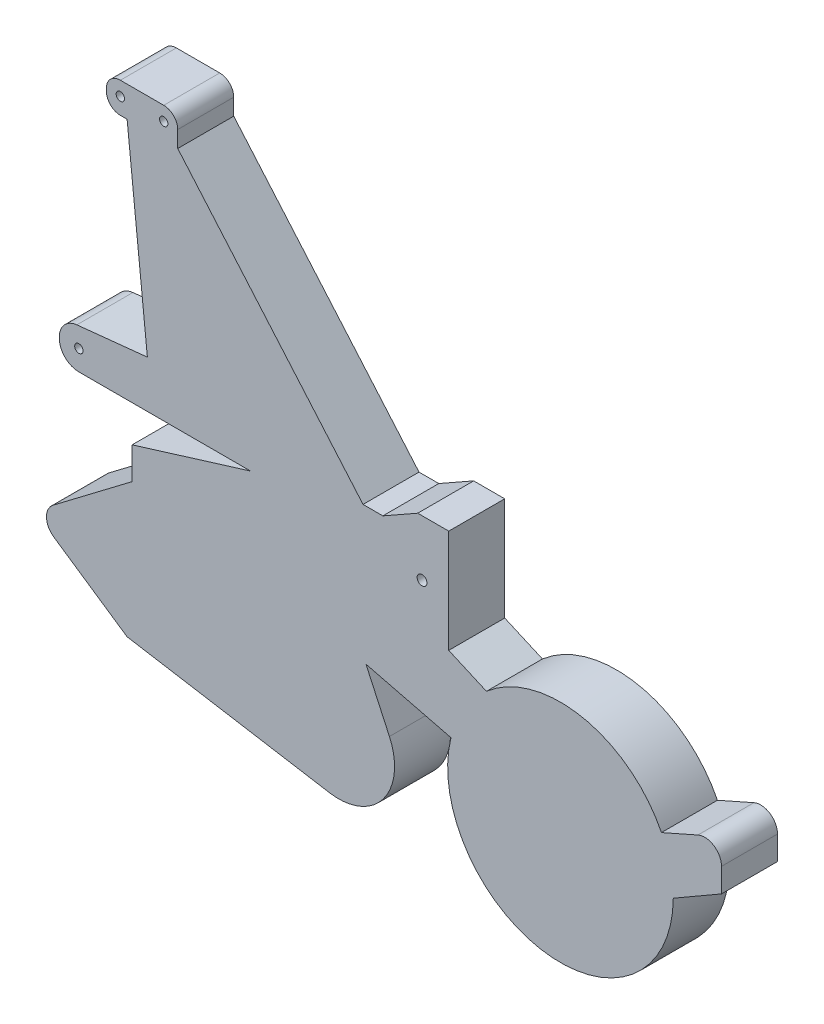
ISO-10303-21;
HEADER;
FILE_DESCRIPTION(('STEP AP214'),'2;1');
FILE_NAME('part.step','',(''),(''),'','','');
FILE_SCHEMA(('AUTOMOTIVE_DESIGN { 1 0 10303 214 1 1 1 1 }'));
ENDSEC;
DATA;
#1=APPLICATION_CONTEXT('core data for automotive mechanical design processes');
#2=APPLICATION_PROTOCOL_DEFINITION('international standard','automotive_design',2000,#1);
#3=PRODUCT_CONTEXT('',#1,'mechanical');
#4=PRODUCT('Part','Part','',(#3));
#5=PRODUCT_RELATED_PRODUCT_CATEGORY('part','',(#4));
#6=PRODUCT_DEFINITION_FORMATION('','',#4);
#7=PRODUCT_DEFINITION_CONTEXT('part definition',#1,'design');
#8=PRODUCT_DEFINITION('design','',#6,#7);
#9=PRODUCT_DEFINITION_SHAPE('','',#8);
#10=(LENGTH_UNIT() NAMED_UNIT(*) SI_UNIT(.MILLI.,.METRE.));
#11=(NAMED_UNIT(*) PLANE_ANGLE_UNIT() SI_UNIT($,.RADIAN.));
#12=(NAMED_UNIT(*) SI_UNIT($,.STERADIAN.) SOLID_ANGLE_UNIT());
#13=UNCERTAINTY_MEASURE_WITH_UNIT(LENGTH_MEASURE(1.E-05),#10,'distance_accuracy_value','');
#14=(GEOMETRIC_REPRESENTATION_CONTEXT(3) GLOBAL_UNCERTAINTY_ASSIGNED_CONTEXT((#13)) GLOBAL_UNIT_ASSIGNED_CONTEXT((#10,
#11,#12)) REPRESENTATION_CONTEXT('',''));
#15=CARTESIAN_POINT('',(0.,0.,0.));
#16=DIRECTION('',(0.,0.,1.));
#17=DIRECTION('',(1.,0.,0.));
#18=AXIS2_PLACEMENT_3D('',#15,#16,#17);
#19=CARTESIAN_POINT('',(460.031150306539,-221.494125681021,-61.8));
#20=DIRECTION('',(0.,0.,1.));
#21=DIRECTION('',(1.,0.,0.));
#22=AXIS2_PLACEMENT_3D('',#19,#20,#21);
#23=CYLINDRICAL_SURFACE('',#22,228.917831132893);
#24=CARTESIAN_POINT('',(460.031150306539,-221.494125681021,51.8));
#25=DIRECTION('',(0.,0.,1.));
#26=DIRECTION('',(1.,0.,0.));
#27=AXIS2_PLACEMENT_3D('',#24,#25,#26);
#28=CIRCLE('',#27,228.917831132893);
#29=CARTESIAN_POINT('',(664.933324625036,-119.423207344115,51.8));
#30=VERTEX_POINT('',#29);
#31=CARTESIAN_POINT('',(309.880680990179,-48.6988422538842,51.8));
#32=VERTEX_POINT('',#31);
#33=EDGE_CURVE('E260',#30,#32,#28,.T.);
#34=ORIENTED_EDGE('',*,*,#33,.F.);
#35=DIRECTION('',(0.,0.,1.));
#36=VECTOR('',#35,1.);
#37=CARTESIAN_POINT('',(664.933324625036,-119.423207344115,-61.8));
#38=LINE('',#37,#36);
#39=CARTESIAN_POINT('',(664.933324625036,-119.423207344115,-61.8));
#40=VERTEX_POINT('',#39);
#41=EDGE_CURVE('E11',#40,#30,#38,.T.);
#42=ORIENTED_EDGE('',*,*,#41,.F.);
#43=CARTESIAN_POINT('',(460.031150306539,-221.494125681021,-61.8));
#44=DIRECTION('',(0.,0.,1.));
#45=DIRECTION('',(1.,0.,0.));
#46=AXIS2_PLACEMENT_3D('',#43,#44,#45);
#47=CIRCLE('',#46,228.917831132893);
#48=CARTESIAN_POINT('',(309.880680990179,-48.6988422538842,-61.8));
#49=VERTEX_POINT('',#48);
#50=EDGE_CURVE('E262',#40,#49,#47,.T.);
#51=ORIENTED_EDGE('',*,*,#50,.T.);
#52=DIRECTION('',(0.,0.,1.));
#53=VECTOR('',#52,1.);
#54=CARTESIAN_POINT('',(309.880680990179,-48.6988422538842,-61.8));
#55=LINE('',#54,#53);
#56=EDGE_CURVE('E43',#49,#32,#55,.T.);
#57=ORIENTED_EDGE('',*,*,#56,.T.);
#58=EDGE_LOOP('',(#34,#42,#51,#57));
#59=FACE_BOUND('',#58,.T.);
#60=ADVANCED_FACE('F40',(#59),#23,.T.);
#61=CARTESIAN_POINT('',(738.946612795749,-86.673086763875,-61.8));
#62=DIRECTION('',(-0.404645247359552,0.914473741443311,0.));
#63=DIRECTION('',(-0.914473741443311,-0.404645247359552,0.));
#64=AXIS2_PLACEMENT_3D('',#61,#62,#63);
#65=PLANE('',#64);
#66=DIRECTION('',(-0.914473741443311,-0.404645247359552,0.));
#67=VECTOR('',#66,1.);
#68=CARTESIAN_POINT('',(738.946612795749,-86.673086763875,51.8));
#69=LINE('',#68,#67);
#70=CARTESIAN_POINT('',(738.946612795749,-86.673086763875,51.8));
#71=VERTEX_POINT('',#70);
#72=EDGE_CURVE('E278',#71,#30,#69,.T.);
#73=ORIENTED_EDGE('',*,*,#72,.F.);
#74=DIRECTION('',(0.,0.,1.));
#75=VECTOR('',#74,1.);
#76=CARTESIAN_POINT('',(738.946612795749,-86.673086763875,-61.8));
#77=LINE('',#76,#75);
#78=CARTESIAN_POINT('',(738.946612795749,-86.673086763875,-61.8));
#79=VERTEX_POINT('',#78);
#80=EDGE_CURVE('E48',#79,#71,#77,.T.);
#81=ORIENTED_EDGE('',*,*,#80,.F.);
#82=DIRECTION('',(-0.914473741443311,-0.404645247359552,0.));
#83=VECTOR('',#82,1.);
#84=CARTESIAN_POINT('',(738.946612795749,-86.673086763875,-61.8));
#85=LINE('',#84,#83);
#86=EDGE_CURVE('E267',#79,#40,#85,.T.);
#87=ORIENTED_EDGE('',*,*,#86,.T.);
#88=ORIENTED_EDGE('',*,*,#41,.T.);
#89=EDGE_LOOP('',(#73,#81,#87,#88));
#90=FACE_BOUND('',#89,.T.);
#91=ADVANCED_FACE('F659',(#90),#65,.T.);
#92=CARTESIAN_POINT('',(752.736922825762,-117.838351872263,-61.8));
#93=DIRECTION('',(0.,0.,1.));
#94=DIRECTION('',(1.,0.,0.));
#95=AXIS2_PLACEMENT_3D('',#92,#93,#94);
#96=CYLINDRICAL_SURFACE('',#95,34.08);
#97=CARTESIAN_POINT('',(752.736922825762,-117.838351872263,51.8));
#98=DIRECTION('',(0.,0.,1.));
#99=DIRECTION('',(-1.,0.,0.));
#100=AXIS2_PLACEMENT_3D('',#97,#98,#99);
#101=CIRCLE('',#100,34.08);
#102=CARTESIAN_POINT('',(786.816922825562,-117.838468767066,51.8));
#103=VERTEX_POINT('',#102);
#104=EDGE_CURVE('E374',#103,#71,#101,.T.);
#105=ORIENTED_EDGE('',*,*,#104,.F.);
#106=DIRECTION('',(0.,0.,1.));
#107=VECTOR('',#106,1.);
#108=CARTESIAN_POINT('',(786.816922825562,-117.838468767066,-61.8));
#109=LINE('',#108,#107);
#110=CARTESIAN_POINT('',(786.816922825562,-117.838468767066,-61.8));
#111=VERTEX_POINT('',#110);
#112=EDGE_CURVE('E473',#111,#103,#109,.T.);
#113=ORIENTED_EDGE('',*,*,#112,.F.);
#114=CARTESIAN_POINT('',(752.736922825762,-117.838351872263,-61.8));
#115=DIRECTION('',(0.,0.,1.));
#116=DIRECTION('',(-1.,0.,0.));
#117=AXIS2_PLACEMENT_3D('',#114,#115,#116);
#118=CIRCLE('',#117,34.08);
#119=EDGE_CURVE('E469',#111,#79,#118,.T.);
#120=ORIENTED_EDGE('',*,*,#119,.T.);
#121=ORIENTED_EDGE('',*,*,#80,.T.);
#122=EDGE_LOOP('',(#105,#113,#120,#121));
#123=FACE_BOUND('',#122,.T.);
#124=ADVANCED_FACE('F657',(#123),#96,.T.);
#125=CARTESIAN_POINT('',(786.816756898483,-166.213543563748,-61.8));
#126=DIRECTION('',(0.999999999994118,-3.43001183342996E-06,0.));
#127=DIRECTION('',(3.43001183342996E-06,0.999999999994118,0.));
#128=AXIS2_PLACEMENT_3D('',#125,#126,#127);
#129=PLANE('',#128);
#130=DIRECTION('',(3.43001183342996E-06,0.999999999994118,0.));
#131=VECTOR('',#130,1.);
#132=CARTESIAN_POINT('',(786.816756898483,-166.213543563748,51.8));
#133=LINE('',#132,#131);
#134=CARTESIAN_POINT('',(786.816756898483,-166.213543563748,51.8));
#135=VERTEX_POINT('',#134);
#136=EDGE_CURVE('E371',#135,#103,#133,.T.);
#137=ORIENTED_EDGE('',*,*,#136,.F.);
#138=DIRECTION('',(0.,0.,1.));
#139=VECTOR('',#138,1.);
#140=CARTESIAN_POINT('',(786.816756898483,-166.213543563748,-61.8));
#141=LINE('',#140,#139);
#142=CARTESIAN_POINT('',(786.816756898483,-166.213543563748,-61.8));
#143=VERTEX_POINT('',#142);
#144=EDGE_CURVE('E475',#143,#135,#141,.T.);
#145=ORIENTED_EDGE('',*,*,#144,.F.);
#146=DIRECTION('',(3.43001183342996E-06,0.999999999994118,0.));
#147=VECTOR('',#146,1.);
#148=CARTESIAN_POINT('',(786.816756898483,-166.213543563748,-61.8));
#149=LINE('',#148,#147);
#150=EDGE_CURVE('E466',#143,#111,#149,.T.);
#151=ORIENTED_EDGE('',*,*,#150,.T.);
#152=ORIENTED_EDGE('',*,*,#112,.T.);
#153=EDGE_LOOP('',(#137,#145,#151,#152));
#154=FACE_BOUND('',#153,.T.);
#155=ADVANCED_FACE('F653',(#154),#129,.T.);
#156=CARTESIAN_POINT('',(786.816756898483,-166.213543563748,-61.8));
#157=DIRECTION('',(0.500409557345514,-0.865788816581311,0.));
#158=DIRECTION('',(0.865788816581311,0.500409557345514,0.));
#159=AXIS2_PLACEMENT_3D('',#156,#157,#158);
#160=PLANE('',#159);
#161=DIRECTION('',(0.865788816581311,0.500409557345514,0.));
#162=VECTOR('',#161,1.);
#163=CARTESIAN_POINT('',(786.816756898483,-166.213543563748,51.8));
#164=LINE('',#163,#162);
#165=CARTESIAN_POINT('',(688.945362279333,-222.781358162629,51.8));
#166=VERTEX_POINT('',#165);
#167=EDGE_CURVE('E368',#166,#135,#164,.T.);
#168=ORIENTED_EDGE('',*,*,#167,.F.);
#169=DIRECTION('',(0.,0.,1.));
#170=VECTOR('',#169,1.);
#171=CARTESIAN_POINT('',(688.945362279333,-222.781358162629,-61.8));
#172=LINE('',#171,#170);
#173=CARTESIAN_POINT('',(688.945362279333,-222.781358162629,-61.8));
#174=VERTEX_POINT('',#173);
#175=EDGE_CURVE('E477',#174,#166,#172,.T.);
#176=ORIENTED_EDGE('',*,*,#175,.F.);
#177=DIRECTION('',(0.865788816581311,0.500409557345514,0.));
#178=VECTOR('',#177,1.);
#179=CARTESIAN_POINT('',(786.816756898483,-166.213543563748,-61.8));
#180=LINE('',#179,#178);
#181=EDGE_CURVE('E463',#174,#143,#180,.T.);
#182=ORIENTED_EDGE('',*,*,#181,.T.);
#183=ORIENTED_EDGE('',*,*,#144,.T.);
#184=EDGE_LOOP('',(#168,#176,#182,#183));
#185=FACE_BOUND('',#184,.T.);
#186=ADVANCED_FACE('F649',(#185),#160,.T.);
#187=CARTESIAN_POINT('',(460.031150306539,-221.494125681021,-61.8));
#188=DIRECTION('',(0.,0.,1.));
#189=DIRECTION('',(1.,0.,0.));
#190=AXIS2_PLACEMENT_3D('',#187,#188,#189);
#191=CYLINDRICAL_SURFACE('',#190,228.917831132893);
#192=CARTESIAN_POINT('',(460.031150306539,-221.494125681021,51.8));
#193=DIRECTION('',(0.,0.,1.));
#194=DIRECTION('',(1.,0.,0.));
#195=AXIS2_PLACEMENT_3D('',#192,#193,#194);
#196=CIRCLE('',#195,228.917831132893);
#197=CARTESIAN_POINT('',(237.888334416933,-166.213543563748,51.8));
#198=VERTEX_POINT('',#197);
#199=EDGE_CURVE('E365',#198,#166,#196,.T.);
#200=ORIENTED_EDGE('',*,*,#199,.F.);
#201=DIRECTION('',(0.,0.,1.));
#202=VECTOR('',#201,1.);
#203=CARTESIAN_POINT('',(237.888334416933,-166.213543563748,-61.8));
#204=LINE('',#203,#202);
#205=CARTESIAN_POINT('',(237.888334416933,-166.213543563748,-61.8));
#206=VERTEX_POINT('',#205);
#207=EDGE_CURVE('E479',#206,#198,#204,.T.);
#208=ORIENTED_EDGE('',*,*,#207,.F.);
#209=CARTESIAN_POINT('',(460.031150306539,-221.494125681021,-61.8));
#210=DIRECTION('',(0.,0.,1.));
#211=DIRECTION('',(1.,0.,0.));
#212=AXIS2_PLACEMENT_3D('',#209,#210,#211);
#213=CIRCLE('',#212,228.917831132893);
#214=EDGE_CURVE('E460',#206,#174,#213,.T.);
#215=ORIENTED_EDGE('',*,*,#214,.T.);
#216=ORIENTED_EDGE('',*,*,#175,.T.);
#217=EDGE_LOOP('',(#200,#208,#215,#216));
#218=FACE_BOUND('',#217,.T.);
#219=ADVANCED_FACE('F645',(#218),#191,.T.);
#220=CARTESIAN_POINT('',(237.888334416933,-166.213543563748,-61.8));
#221=DIRECTION('',(-0.241486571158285,-0.970404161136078,0.));
#222=DIRECTION('',(0.970404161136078,-0.241486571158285,0.));
#223=AXIS2_PLACEMENT_3D('',#220,#221,#222);
#224=PLANE('',#223);
#225=DIRECTION('',(0.970404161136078,-0.241486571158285,0.));
#226=VECTOR('',#225,1.);
#227=CARTESIAN_POINT('',(237.888334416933,-166.213543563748,51.8));
#228=LINE('',#227,#226);
#229=CARTESIAN_POINT('',(65.3918024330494,-123.287515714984,51.8));
#230=VERTEX_POINT('',#229);
#231=EDGE_CURVE('E362',#230,#198,#228,.T.);
#232=ORIENTED_EDGE('',*,*,#231,.F.);
#233=DIRECTION('',(0.,0.,1.));
#234=VECTOR('',#233,1.);
#235=CARTESIAN_POINT('',(65.3918024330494,-123.287515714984,-61.8));
#236=LINE('',#235,#234);
#237=CARTESIAN_POINT('',(65.3918024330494,-123.287515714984,-61.8));
#238=VERTEX_POINT('',#237);
#239=EDGE_CURVE('E481',#238,#230,#236,.T.);
#240=ORIENTED_EDGE('',*,*,#239,.F.);
#241=DIRECTION('',(0.970404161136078,-0.241486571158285,0.));
#242=VECTOR('',#241,1.);
#243=CARTESIAN_POINT('',(237.888334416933,-166.213543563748,-61.8));
#244=LINE('',#243,#242);
#245=EDGE_CURVE('E457',#238,#206,#244,.T.);
#246=ORIENTED_EDGE('',*,*,#245,.T.);
#247=ORIENTED_EDGE('',*,*,#207,.T.);
#248=EDGE_LOOP('',(#232,#240,#246,#247));
#249=FACE_BOUND('',#248,.T.);
#250=ADVANCED_FACE('F641',(#249),#224,.T.);
#251=CARTESIAN_POINT('',(65.3918024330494,-123.287515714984,-61.8));
#252=DIRECTION('',(0.908109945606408,0.418731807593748,0.));
#253=DIRECTION('',(-0.418731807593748,0.908109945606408,0.));
#254=AXIS2_PLACEMENT_3D('',#251,#252,#253);
#255=PLANE('',#254);
#256=DIRECTION('',(-0.418731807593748,0.908109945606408,0.));
#257=VECTOR('',#256,1.);
#258=CARTESIAN_POINT('',(65.3918024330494,-123.287515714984,51.8));
#259=LINE('',#258,#257);
#260=CARTESIAN_POINT('',(113.000601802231,-226.537432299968,51.8));
#261=VERTEX_POINT('',#260);
#262=EDGE_CURVE('E359',#261,#230,#259,.T.);
#263=ORIENTED_EDGE('',*,*,#262,.F.);
#264=DIRECTION('',(0.,0.,1.));
#265=VECTOR('',#264,1.);
#266=CARTESIAN_POINT('',(113.000601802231,-226.537432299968,-61.8));
#267=LINE('',#266,#265);
#268=CARTESIAN_POINT('',(113.000601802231,-226.537432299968,-61.8));
#269=VERTEX_POINT('',#268);
#270=EDGE_CURVE('E483',#269,#261,#267,.T.);
#271=ORIENTED_EDGE('',*,*,#270,.F.);
#272=DIRECTION('',(-0.418731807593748,0.908109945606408,0.));
#273=VECTOR('',#272,1.);
#274=CARTESIAN_POINT('',(65.3918024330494,-123.287515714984,-61.8));
#275=LINE('',#274,#273);
#276=EDGE_CURVE('E454',#269,#238,#275,.T.);
#277=ORIENTED_EDGE('',*,*,#276,.T.);
#278=ORIENTED_EDGE('',*,*,#239,.T.);
#279=EDGE_LOOP('',(#263,#271,#277,#278));
#280=FACE_BOUND('',#279,.T.);
#281=ADVANCED_FACE('F637',(#280),#255,.T.);
#282=CARTESIAN_POINT('',(9.83931198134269,-274.105365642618,-61.8));
#283=DIRECTION('',(0.,0.,1.));
#284=DIRECTION('',(1.,0.,0.));
#285=AXIS2_PLACEMENT_3D('',#282,#283,#284);
#286=CYLINDRICAL_SURFACE('',#285,113.6);
#287=CARTESIAN_POINT('',(9.83931198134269,-274.105365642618,51.8));
#288=DIRECTION('',(0.,0.,1.));
#289=DIRECTION('',(1.,0.,0.));
#290=AXIS2_PLACEMENT_3D('',#287,#288,#289);
#291=CIRCLE('',#290,113.6);
#292=CARTESIAN_POINT('',(-8.89333512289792,-386.150213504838,51.8));
#293=VERTEX_POINT('',#292);
#294=EDGE_CURVE('E356',#293,#261,#291,.T.);
#295=ORIENTED_EDGE('',*,*,#294,.F.);
#296=DIRECTION('',(0.,0.,1.));
#297=VECTOR('',#296,1.);
#298=CARTESIAN_POINT('',(-8.89333512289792,-386.150213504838,-61.8));
#299=LINE('',#298,#297);
#300=CARTESIAN_POINT('',(-8.89333512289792,-386.150213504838,-61.8));
#301=VERTEX_POINT('',#300);
#302=EDGE_CURVE('E485',#301,#293,#299,.T.);
#303=ORIENTED_EDGE('',*,*,#302,.F.);
#304=CARTESIAN_POINT('',(9.83931198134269,-274.105365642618,-61.8));
#305=DIRECTION('',(0.,0.,1.));
#306=DIRECTION('',(1.,0.,0.));
#307=AXIS2_PLACEMENT_3D('',#304,#305,#306);
#308=CIRCLE('',#307,113.6);
#309=EDGE_CURVE('E451',#301,#269,#308,.T.);
#310=ORIENTED_EDGE('',*,*,#309,.T.);
#311=ORIENTED_EDGE('',*,*,#270,.T.);
#312=EDGE_LOOP('',(#295,#303,#310,#311));
#313=FACE_BOUND('',#312,.T.);
#314=ADVANCED_FACE('F633',(#313),#286,.T.);
#315=CARTESIAN_POINT('',(-8.89333512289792,-386.150213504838,-61.8));
#316=DIRECTION('',(-0.164900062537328,-0.986310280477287,0.));
#317=DIRECTION('',(0.986310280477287,-0.164900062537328,0.));
#318=AXIS2_PLACEMENT_3D('',#315,#316,#317);
#319=PLANE('',#318);
#320=DIRECTION('',(0.986310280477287,-0.164900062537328,0.));
#321=VECTOR('',#320,1.);
#322=CARTESIAN_POINT('',(-8.89333512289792,-386.150213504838,51.8));
#323=LINE('',#322,#321);
#324=CARTESIAN_POINT('',(-419.258489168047,-317.541743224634,51.8));
#325=VERTEX_POINT('',#324);
#326=EDGE_CURVE('E353',#325,#293,#323,.T.);
#327=ORIENTED_EDGE('',*,*,#326,.F.);
#328=DIRECTION('',(0.,0.,1.));
#329=VECTOR('',#328,1.);
#330=CARTESIAN_POINT('',(-419.258489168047,-317.541743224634,-61.8));
#331=LINE('',#330,#329);
#332=CARTESIAN_POINT('',(-419.258489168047,-317.541743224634,-61.8));
#333=VERTEX_POINT('',#332);
#334=EDGE_CURVE('E487',#333,#325,#331,.T.);
#335=ORIENTED_EDGE('',*,*,#334,.F.);
#336=DIRECTION('',(0.986310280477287,-0.164900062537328,0.));
#337=VECTOR('',#336,1.);
#338=CARTESIAN_POINT('',(-8.89333512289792,-386.150213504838,-61.8));
#339=LINE('',#338,#337);
#340=EDGE_CURVE('E448',#333,#301,#339,.T.);
#341=ORIENTED_EDGE('',*,*,#340,.T.);
#342=ORIENTED_EDGE('',*,*,#302,.T.);
#343=EDGE_LOOP('',(#327,#335,#341,#342));
#344=FACE_BOUND('',#343,.T.);
#345=ADVANCED_FACE('F629',(#344),#319,.T.);
#346=CARTESIAN_POINT('',(-419.258489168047,-317.541743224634,-61.8));
#347=DIRECTION('',(-0.561644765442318,-0.827378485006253,0.));
#348=DIRECTION('',(0.827378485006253,-0.561644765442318,0.));
#349=AXIS2_PLACEMENT_3D('',#346,#347,#348);
#350=PLANE('',#349);
#351=DIRECTION('',(0.827378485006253,-0.561644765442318,0.));
#352=VECTOR('',#351,1.);
#353=CARTESIAN_POINT('',(-419.258489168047,-317.541743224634,51.8));
#354=LINE('',#353,#352);
#355=CARTESIAN_POINT('',(-567.913551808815,-216.631048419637,51.8));
#356=VERTEX_POINT('',#355);
#357=EDGE_CURVE('E350',#356,#325,#354,.T.);
#358=ORIENTED_EDGE('',*,*,#357,.F.);
#359=DIRECTION('',(0.,0.,1.));
#360=VECTOR('',#359,1.);
#361=CARTESIAN_POINT('',(-567.913551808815,-216.631048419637,-61.8));
#362=LINE('',#361,#360);
#363=CARTESIAN_POINT('',(-567.913551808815,-216.631048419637,-61.8));
#364=VERTEX_POINT('',#363);
#365=EDGE_CURVE('E489',#364,#356,#362,.T.);
#366=ORIENTED_EDGE('',*,*,#365,.F.);
#367=DIRECTION('',(0.827378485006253,-0.561644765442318,0.));
#368=VECTOR('',#367,1.);
#369=CARTESIAN_POINT('',(-419.258489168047,-317.541743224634,-61.8));
#370=LINE('',#369,#368);
#371=EDGE_CURVE('E445',#364,#333,#370,.T.);
#372=ORIENTED_EDGE('',*,*,#371,.T.);
#373=ORIENTED_EDGE('',*,*,#334,.T.);
#374=EDGE_LOOP('',(#358,#366,#372,#373));
#375=FACE_BOUND('',#374,.T.);
#376=ADVANCED_FACE('F625',(#375),#350,.T.);
#377=CARTESIAN_POINT('',(-548.772698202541,-188.433989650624,-61.8));
#378=DIRECTION('',(0.,0.,1.));
#379=DIRECTION('',(1.,0.,0.));
#380=AXIS2_PLACEMENT_3D('',#377,#378,#379);
#381=CYLINDRICAL_SURFACE('',#380,34.08);
#382=CARTESIAN_POINT('',(-548.772698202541,-188.433989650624,51.8));
#383=DIRECTION('',(0.,0.,1.));
#384=DIRECTION('',(-1.,0.,0.));
#385=AXIS2_PLACEMENT_3D('',#382,#383,#384);
#386=CIRCLE('',#385,34.08);
#387=CARTESIAN_POINT('',(-569.36060090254,-161.275479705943,51.8));
#388=VERTEX_POINT('',#387);
#389=EDGE_CURVE('E347',#388,#356,#386,.T.);
#390=ORIENTED_EDGE('',*,*,#389,.F.);
#391=DIRECTION('',(0.,0.,1.));
#392=VECTOR('',#391,1.);
#393=CARTESIAN_POINT('',(-569.36060090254,-161.275479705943,-61.8));
#394=LINE('',#393,#392);
#395=CARTESIAN_POINT('',(-569.36060090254,-161.275479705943,-61.8));
#396=VERTEX_POINT('',#395);
#397=EDGE_CURVE('E491',#396,#388,#394,.T.);
#398=ORIENTED_EDGE('',*,*,#397,.F.);
#399=CARTESIAN_POINT('',(-548.772698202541,-188.433989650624,-61.8));
#400=DIRECTION('',(0.,0.,1.));
#401=DIRECTION('',(-1.,0.,0.));
#402=AXIS2_PLACEMENT_3D('',#399,#400,#401);
#403=CIRCLE('',#402,34.08);
#404=EDGE_CURVE('E442',#396,#364,#403,.T.);
#405=ORIENTED_EDGE('',*,*,#404,.T.);
#406=ORIENTED_EDGE('',*,*,#365,.T.);
#407=EDGE_LOOP('',(#390,#398,#405,#406));
#408=FACE_BOUND('',#407,.T.);
#409=ADVANCED_FACE('F621',(#408),#381,.T.);
#410=CARTESIAN_POINT('',(-569.36060090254,-161.275479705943,-61.8));
#411=DIRECTION('',(-0.60410512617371,0.796904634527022,0.));
#412=DIRECTION('',(-0.796904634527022,-0.60410512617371,0.));
#413=AXIS2_PLACEMENT_3D('',#410,#411,#412);
#414=PLANE('',#413);
#415=DIRECTION('',(-0.796904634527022,-0.60410512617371,0.));
#416=VECTOR('',#415,1.);
#417=CARTESIAN_POINT('',(-569.36060090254,-161.275479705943,51.8));
#418=LINE('',#417,#416);
#419=CARTESIAN_POINT('',(-408.962527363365,-39.6833917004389,51.8));
#420=VERTEX_POINT('',#419);
#421=EDGE_CURVE('E344',#420,#388,#418,.T.);
#422=ORIENTED_EDGE('',*,*,#421,.F.);
#423=DIRECTION('',(0.,0.,1.));
#424=VECTOR('',#423,1.);
#425=CARTESIAN_POINT('',(-408.962527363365,-39.6833917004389,-61.8));
#426=LINE('',#425,#424);
#427=CARTESIAN_POINT('',(-408.962527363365,-39.6833917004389,-61.8));
#428=VERTEX_POINT('',#427);
#429=EDGE_CURVE('E493',#428,#420,#426,.T.);
#430=ORIENTED_EDGE('',*,*,#429,.F.);
#431=DIRECTION('',(-0.796904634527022,-0.60410512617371,0.));
#432=VECTOR('',#431,1.);
#433=CARTESIAN_POINT('',(-569.36060090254,-161.275479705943,-61.8));
#434=LINE('',#433,#432);
#435=EDGE_CURVE('E439',#428,#396,#434,.T.);
#436=ORIENTED_EDGE('',*,*,#435,.T.);
#437=ORIENTED_EDGE('',*,*,#397,.T.);
#438=EDGE_LOOP('',(#422,#430,#436,#437));
#439=FACE_BOUND('',#438,.T.);
#440=ADVANCED_FACE('F617',(#439),#414,.T.);
#441=CARTESIAN_POINT('',(-408.962527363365,-39.6833917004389,-61.8));
#442=DIRECTION('',(-1.,0.,0.));
#443=DIRECTION('',(0.,0.,1.));
#444=AXIS2_PLACEMENT_3D('',#441,#442,#443);
#445=PLANE('',#444);
#446=DIRECTION('',(0.,-1.,0.));
#447=VECTOR('',#446,1.);
#448=CARTESIAN_POINT('',(-408.962527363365,-39.6833917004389,51.8));
#449=LINE('',#448,#447);
#450=CARTESIAN_POINT('',(-408.962527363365,25.028903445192,51.8));
#451=VERTEX_POINT('',#450);
#452=EDGE_CURVE('E341',#451,#420,#449,.T.);
#453=ORIENTED_EDGE('',*,*,#452,.F.);
#454=DIRECTION('',(0.,0.,1.));
#455=VECTOR('',#454,1.);
#456=CARTESIAN_POINT('',(-408.962527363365,25.028903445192,-61.8));
#457=LINE('',#456,#455);
#458=CARTESIAN_POINT('',(-408.962527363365,25.028903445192,-61.8));
#459=VERTEX_POINT('',#458);
#460=EDGE_CURVE('E495',#459,#451,#457,.T.);
#461=ORIENTED_EDGE('',*,*,#460,.F.);
#462=DIRECTION('',(0.,-1.,0.));
#463=VECTOR('',#462,1.);
#464=CARTESIAN_POINT('',(-408.962527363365,-39.6833917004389,-61.8));
#465=LINE('',#464,#463);
#466=EDGE_CURVE('E436',#459,#428,#465,.T.);
#467=ORIENTED_EDGE('',*,*,#466,.T.);
#468=ORIENTED_EDGE('',*,*,#429,.T.);
#469=EDGE_LOOP('',(#453,#461,#467,#468));
#470=FACE_BOUND('',#469,.T.);
#471=ADVANCED_FACE('F613',(#470),#445,.T.);
#472=CARTESIAN_POINT('',(-408.962527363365,25.028903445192,-61.8));
#473=DIRECTION('',(-0.294085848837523,0.95577900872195,0.));
#474=DIRECTION('',(-0.95577900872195,-0.294085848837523,0.));
#475=AXIS2_PLACEMENT_3D('',#472,#473,#474);
#476=PLANE('',#475);
#477=DIRECTION('',(-0.95577900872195,-0.294085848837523,0.));
#478=VECTOR('',#477,1.);
#479=CARTESIAN_POINT('',(-408.962527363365,25.028903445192,51.8));
#480=LINE('',#479,#478);
#481=CARTESIAN_POINT('',(-168.602573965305,98.9858121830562,51.8));
#482=VERTEX_POINT('',#481);
#483=EDGE_CURVE('E338',#482,#451,#480,.T.);
#484=ORIENTED_EDGE('',*,*,#483,.F.);
#485=DIRECTION('',(0.,0.,1.));
#486=VECTOR('',#485,1.);
#487=CARTESIAN_POINT('',(-168.602573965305,98.9858121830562,-61.8));
#488=LINE('',#487,#486);
#489=CARTESIAN_POINT('',(-168.602573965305,98.9858121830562,-61.8));
#490=VERTEX_POINT('',#489);
#491=EDGE_CURVE('E497',#490,#482,#488,.T.);
#492=ORIENTED_EDGE('',*,*,#491,.F.);
#493=DIRECTION('',(-0.95577900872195,-0.294085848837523,0.));
#494=VECTOR('',#493,1.);
#495=CARTESIAN_POINT('',(-408.962527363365,25.028903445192,-61.8));
#496=LINE('',#495,#494);
#497=EDGE_CURVE('E433',#490,#459,#496,.T.);
#498=ORIENTED_EDGE('',*,*,#497,.T.);
#499=ORIENTED_EDGE('',*,*,#460,.T.);
#500=EDGE_LOOP('',(#484,#492,#498,#499));
#501=FACE_BOUND('',#500,.T.);
#502=ADVANCED_FACE('F609',(#501),#476,.T.);
#503=CARTESIAN_POINT('',(-168.602573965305,98.9858121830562,-61.8));
#504=DIRECTION('',(0.,-1.,0.));
#505=DIRECTION('',(0.,0.,-1.));
#506=AXIS2_PLACEMENT_3D('',#503,#504,#505);
#507=PLANE('',#506);
#508=DIRECTION('',(1.,0.,0.));
#509=VECTOR('',#508,1.);
#510=CARTESIAN_POINT('',(-168.602573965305,98.9858121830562,51.8));
#511=LINE('',#510,#509);
#512=CARTESIAN_POINT('',(-517.116344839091,98.9858121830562,51.8));
#513=VERTEX_POINT('',#512);
#514=EDGE_CURVE('E335',#513,#482,#511,.T.);
#515=ORIENTED_EDGE('',*,*,#514,.F.);
#516=DIRECTION('',(0.,0.,1.));
#517=VECTOR('',#516,1.);
#518=CARTESIAN_POINT('',(-517.116344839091,98.9858121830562,-61.8));
#519=LINE('',#518,#517);
#520=CARTESIAN_POINT('',(-517.116344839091,98.9858121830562,-61.8));
#521=VERTEX_POINT('',#520);
#522=EDGE_CURVE('E499',#521,#513,#519,.T.);
#523=ORIENTED_EDGE('',*,*,#522,.F.);
#524=DIRECTION('',(1.,0.,0.));
#525=VECTOR('',#524,1.);
#526=CARTESIAN_POINT('',(-168.602573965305,98.9858121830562,-61.8));
#527=LINE('',#526,#525);
#528=EDGE_CURVE('E430',#521,#490,#527,.T.);
#529=ORIENTED_EDGE('',*,*,#528,.T.);
#530=ORIENTED_EDGE('',*,*,#491,.T.);
#531=EDGE_LOOP('',(#515,#523,#529,#530));
#532=FACE_BOUND('',#531,.T.);
#533=ADVANCED_FACE('F605',(#532),#507,.T.);
#534=CARTESIAN_POINT('',(-517.116344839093,138.745812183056,-61.8));
#535=DIRECTION('',(0.,0.,1.));
#536=DIRECTION('',(1.,0.,0.));
#537=AXIS2_PLACEMENT_3D('',#534,#535,#536);
#538=CYLINDRICAL_SURFACE('',#537,39.76);
#539=CARTESIAN_POINT('',(-517.116344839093,138.745812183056,51.8));
#540=DIRECTION('',(0.,0.,1.));
#541=DIRECTION('',(-1.,0.,0.));
#542=AXIS2_PLACEMENT_3D('',#539,#540,#541);
#543=CIRCLE('',#542,39.76);
#544=CARTESIAN_POINT('',(-556.876344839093,138.745812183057,51.8));
#545=VERTEX_POINT('',#544);
#546=EDGE_CURVE('E332',#545,#513,#543,.T.);
#547=ORIENTED_EDGE('',*,*,#546,.F.);
#548=DIRECTION('',(0.,0.,1.));
#549=VECTOR('',#548,1.);
#550=CARTESIAN_POINT('',(-556.876344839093,138.745812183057,-61.8));
#551=LINE('',#550,#549);
#552=CARTESIAN_POINT('',(-556.876344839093,138.745812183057,-61.8));
#553=VERTEX_POINT('',#552);
#554=EDGE_CURVE('E501',#553,#545,#551,.T.);
#555=ORIENTED_EDGE('',*,*,#554,.F.);
#556=CARTESIAN_POINT('',(-517.116344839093,138.745812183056,-61.8));
#557=DIRECTION('',(0.,0.,1.));
#558=DIRECTION('',(-1.,0.,0.));
#559=AXIS2_PLACEMENT_3D('',#556,#557,#558);
#560=CIRCLE('',#559,39.76);
#561=EDGE_CURVE('E427',#553,#521,#560,.T.);
#562=ORIENTED_EDGE('',*,*,#561,.T.);
#563=ORIENTED_EDGE('',*,*,#522,.T.);
#564=EDGE_LOOP('',(#547,#555,#562,#563));
#565=FACE_BOUND('',#564,.T.);
#566=ADVANCED_FACE('F601',(#565),#538,.T.);
#567=CARTESIAN_POINT('',(-556.876344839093,138.745812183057,-61.8));
#568=DIRECTION('',(-1.,0.,0.));
#569=DIRECTION('',(0.,0.,1.));
#570=AXIS2_PLACEMENT_3D('',#567,#568,#569);
#571=PLANE('',#570);
#572=DIRECTION('',(0.,-1.,0.));
#573=VECTOR('',#572,1.);
#574=CARTESIAN_POINT('',(-556.876344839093,138.745812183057,51.8));
#575=LINE('',#574,#573);
#576=CARTESIAN_POINT('',(-556.876344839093,140.165181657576,51.8));
#577=VERTEX_POINT('',#576);
#578=EDGE_CURVE('E329',#577,#545,#575,.T.);
#579=ORIENTED_EDGE('',*,*,#578,.F.);
#580=DIRECTION('',(0.,0.,1.));
#581=VECTOR('',#580,1.);
#582=CARTESIAN_POINT('',(-556.876344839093,140.165181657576,-61.8));
#583=LINE('',#582,#581);
#584=CARTESIAN_POINT('',(-556.876344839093,140.165181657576,-61.8));
#585=VERTEX_POINT('',#584);
#586=EDGE_CURVE('E503',#585,#577,#583,.T.);
#587=ORIENTED_EDGE('',*,*,#586,.F.);
#588=DIRECTION('',(0.,-1.,0.));
#589=VECTOR('',#588,1.);
#590=CARTESIAN_POINT('',(-556.876344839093,138.745812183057,-61.8));
#591=LINE('',#590,#589);
#592=EDGE_CURVE('E424',#585,#553,#591,.T.);
#593=ORIENTED_EDGE('',*,*,#592,.T.);
#594=ORIENTED_EDGE('',*,*,#554,.T.);
#595=EDGE_LOOP('',(#579,#587,#593,#594));
#596=FACE_BOUND('',#595,.T.);
#597=ADVANCED_FACE('F597',(#596),#571,.T.);
#598=CARTESIAN_POINT('',(-517.116344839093,140.165181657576,-61.8));
#599=DIRECTION('',(0.,0.,1.));
#600=DIRECTION('',(1.,0.,0.));
#601=AXIS2_PLACEMENT_3D('',#598,#599,#600);
#602=CYLINDRICAL_SURFACE('',#601,39.76);
#603=CARTESIAN_POINT('',(-517.116344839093,140.165181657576,51.8));
#604=DIRECTION('',(0.,0.,1.));
#605=DIRECTION('',(-1.,0.,0.));
#606=AXIS2_PLACEMENT_3D('',#603,#604,#605);
#607=CIRCLE('',#606,39.76);
#608=CARTESIAN_POINT('',(-521.207615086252,179.71412738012,51.8));
#609=VERTEX_POINT('',#608);
#610=EDGE_CURVE('E326',#609,#577,#607,.T.);
#611=ORIENTED_EDGE('',*,*,#610,.F.);
#612=DIRECTION('',(0.,0.,1.));
#613=VECTOR('',#612,1.);
#614=CARTESIAN_POINT('',(-521.207615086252,179.71412738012,-61.8));
#615=LINE('',#614,#613);
#616=CARTESIAN_POINT('',(-521.207615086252,179.71412738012,-61.8));
#617=VERTEX_POINT('',#616);
#618=EDGE_CURVE('E505',#617,#609,#615,.T.);
#619=ORIENTED_EDGE('',*,*,#618,.F.);
#620=CARTESIAN_POINT('',(-517.116344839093,140.165181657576,-61.8));
#621=DIRECTION('',(0.,0.,1.));
#622=DIRECTION('',(-1.,0.,0.));
#623=AXIS2_PLACEMENT_3D('',#620,#621,#622);
#624=CIRCLE('',#623,39.76);
#625=EDGE_CURVE('E421',#617,#585,#624,.T.);
#626=ORIENTED_EDGE('',*,*,#625,.T.);
#627=ORIENTED_EDGE('',*,*,#586,.T.);
#628=EDGE_LOOP('',(#611,#619,#626,#627));
#629=FACE_BOUND('',#628,.T.);
#630=ADVANCED_FACE('F595',(#629),#602,.T.);
#631=CARTESIAN_POINT('',(-521.207615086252,179.71412738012,-61.8));
#632=DIRECTION('',(-0.102899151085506,0.994691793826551,0.));
#633=DIRECTION('',(-0.994691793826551,-0.102899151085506,0.));
#634=AXIS2_PLACEMENT_3D('',#631,#632,#633);
#635=PLANE('',#634);
#636=DIRECTION('',(-0.994691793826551,-0.102899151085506,0.));
#637=VECTOR('',#636,1.);
#638=CARTESIAN_POINT('',(-521.207615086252,179.71412738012,51.8));
#639=LINE('',#638,#637);
#640=CARTESIAN_POINT('',(-378.147148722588,194.513485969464,51.8));
#641=VERTEX_POINT('',#640);
#642=EDGE_CURVE('E323',#641,#609,#639,.T.);
#643=ORIENTED_EDGE('',*,*,#642,.F.);
#644=DIRECTION('',(0.,0.,1.));
#645=VECTOR('',#644,1.);
#646=CARTESIAN_POINT('',(-378.147148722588,194.513485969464,-61.8));
#647=LINE('',#646,#645);
#648=CARTESIAN_POINT('',(-378.147148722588,194.513485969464,-61.8));
#649=VERTEX_POINT('',#648);
#650=EDGE_CURVE('E507',#649,#641,#647,.T.);
#651=ORIENTED_EDGE('',*,*,#650,.F.);
#652=DIRECTION('',(-0.994691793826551,-0.102899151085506,0.));
#653=VECTOR('',#652,1.);
#654=CARTESIAN_POINT('',(-521.207615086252,179.71412738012,-61.8));
#655=LINE('',#654,#653);
#656=EDGE_CURVE('E418',#649,#617,#655,.T.);
#657=ORIENTED_EDGE('',*,*,#656,.T.);
#658=ORIENTED_EDGE('',*,*,#618,.T.);
#659=EDGE_LOOP('',(#643,#651,#657,#658));
#660=FACE_BOUND('',#659,.T.);
#661=ADVANCED_FACE('F591',(#660),#635,.T.);
#662=CARTESIAN_POINT('',(-378.147148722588,194.513485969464,-61.8));
#663=DIRECTION('',(-0.994691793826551,-0.102899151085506,0.));
#664=DIRECTION('',(0.102899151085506,-0.994691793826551,0.));
#665=AXIS2_PLACEMENT_3D('',#662,#663,#664);
#666=PLANE('',#665);
#667=DIRECTION('',(0.102899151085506,-0.994691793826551,0.));
#668=VECTOR('',#667,1.);
#669=CARTESIAN_POINT('',(-378.147148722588,194.513485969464,51.8));
#670=LINE('',#669,#668);
#671=CARTESIAN_POINT('',(-419.258489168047,591.923110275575,51.8));
#672=VERTEX_POINT('',#671);
#673=EDGE_CURVE('E320',#672,#641,#670,.T.);
#674=ORIENTED_EDGE('',*,*,#673,.F.);
#675=DIRECTION('',(0.,0.,1.));
#676=VECTOR('',#675,1.);
#677=CARTESIAN_POINT('',(-419.258489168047,591.923110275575,-61.8));
#678=LINE('',#677,#676);
#679=CARTESIAN_POINT('',(-419.258489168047,591.923110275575,-61.8));
#680=VERTEX_POINT('',#679);
#681=EDGE_CURVE('E509',#680,#672,#678,.T.);
#682=ORIENTED_EDGE('',*,*,#681,.F.);
#683=DIRECTION('',(0.102899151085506,-0.994691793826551,0.));
#684=VECTOR('',#683,1.);
#685=CARTESIAN_POINT('',(-385.281815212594,263.481928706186,-61.8));
#686=LINE('',#685,#684);
#687=EDGE_CURVE('E416',#680,#649,#686,.T.);
#688=ORIENTED_EDGE('',*,*,#687,.T.);
#689=ORIENTED_EDGE('',*,*,#650,.T.);
#690=EDGE_LOOP('',(#674,#682,#688,#689));
#691=FACE_BOUND('',#690,.T.);
#692=ADVANCED_FACE('F582',(#691),#666,.T.);
#693=CARTESIAN_POINT('',(-419.258489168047,591.923110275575,-61.8));
#694=DIRECTION('',(0.,-1.,0.));
#695=DIRECTION('',(0.,0.,-1.));
#696=AXIS2_PLACEMENT_3D('',#693,#694,#695);
#697=PLANE('',#696);
#698=DIRECTION('',(1.,0.,0.));
#699=VECTOR('',#698,1.);
#700=CARTESIAN_POINT('',(-419.258489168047,591.923110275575,51.8));
#701=LINE('',#700,#699);
#702=CARTESIAN_POINT('',(-432.948671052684,591.923110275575,51.8));
#703=VERTEX_POINT('',#702);
#704=EDGE_CURVE('E317',#703,#672,#701,.T.);
#705=ORIENTED_EDGE('',*,*,#704,.F.);
#706=DIRECTION('',(0.,0.,1.));
#707=VECTOR('',#706,1.);
#708=CARTESIAN_POINT('',(-432.948671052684,591.923110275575,-61.8));
#709=LINE('',#708,#707);
#710=CARTESIAN_POINT('',(-432.948671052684,591.923110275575,-61.8));
#711=VERTEX_POINT('',#710);
#712=EDGE_CURVE('E512',#711,#703,#709,.T.);
#713=ORIENTED_EDGE('',*,*,#712,.F.);
#714=DIRECTION('',(1.,0.,0.));
#715=VECTOR('',#714,1.);
#716=CARTESIAN_POINT('',(-419.258489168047,591.923110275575,-61.8));
#717=LINE('',#716,#715);
#718=EDGE_CURVE('E413',#711,#680,#717,.T.);
#719=ORIENTED_EDGE('',*,*,#718,.T.);
#720=ORIENTED_EDGE('',*,*,#681,.T.);
#721=EDGE_LOOP('',(#705,#713,#719,#720));
#722=FACE_BOUND('',#721,.T.);
#723=ADVANCED_FACE('F578',(#722),#697,.T.);
#724=CARTESIAN_POINT('',(-432.948671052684,620.323110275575,-61.8));
#725=DIRECTION('',(0.,0.,1.));
#726=DIRECTION('',(1.,0.,0.));
#727=AXIS2_PLACEMENT_3D('',#724,#725,#726);
#728=CYLINDRICAL_SURFACE('',#727,28.4);
#729=CARTESIAN_POINT('',(-432.948671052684,620.323110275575,51.8));
#730=DIRECTION('',(0.,0.,1.));
#731=DIRECTION('',(-1.,0.,0.));
#732=AXIS2_PLACEMENT_3D('',#729,#730,#731);
#733=CIRCLE('',#732,28.4);
#734=CARTESIAN_POINT('',(-461.348671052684,620.323110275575,51.8));
#735=VERTEX_POINT('',#734);
#736=EDGE_CURVE('E314',#735,#703,#733,.T.);
#737=ORIENTED_EDGE('',*,*,#736,.F.);
#738=DIRECTION('',(0.,0.,1.));
#739=VECTOR('',#738,1.);
#740=CARTESIAN_POINT('',(-461.348671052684,620.323110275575,-61.8));
#741=LINE('',#740,#739);
#742=CARTESIAN_POINT('',(-461.348671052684,620.323110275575,-61.8));
#743=VERTEX_POINT('',#742);
#744=EDGE_CURVE('E514',#743,#735,#741,.T.);
#745=ORIENTED_EDGE('',*,*,#744,.F.);
#746=CARTESIAN_POINT('',(-432.948671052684,620.323110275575,-61.8));
#747=DIRECTION('',(0.,0.,1.));
#748=DIRECTION('',(-1.,0.,0.));
#749=AXIS2_PLACEMENT_3D('',#746,#747,#748);
#750=CIRCLE('',#749,28.4);
#751=EDGE_CURVE('E410',#743,#711,#750,.T.);
#752=ORIENTED_EDGE('',*,*,#751,.T.);
#753=ORIENTED_EDGE('',*,*,#712,.T.);
#754=EDGE_LOOP('',(#737,#745,#752,#753));
#755=FACE_BOUND('',#754,.T.);
#756=ADVANCED_FACE('F575',(#755),#728,.T.);
#757=CARTESIAN_POINT('',(-461.348671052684,620.323110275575,-61.8));
#758=DIRECTION('',(-1.,0.,0.));
#759=DIRECTION('',(0.,0.,1.));
#760=AXIS2_PLACEMENT_3D('',#757,#758,#759);
#761=PLANE('',#760);
#762=DIRECTION('',(0.,-1.,0.));
#763=VECTOR('',#762,1.);
#764=CARTESIAN_POINT('',(-461.348671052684,620.323110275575,51.8));
#765=LINE('',#764,#763);
#766=CARTESIAN_POINT('',(-461.348671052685,625.262627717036,51.8));
#767=VERTEX_POINT('',#766);
#768=EDGE_CURVE('E311',#767,#735,#765,.T.);
#769=ORIENTED_EDGE('',*,*,#768,.F.);
#770=DIRECTION('',(0.,0.,1.));
#771=VECTOR('',#770,1.);
#772=CARTESIAN_POINT('',(-461.348671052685,625.262627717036,-61.8));
#773=LINE('',#772,#771);
#774=CARTESIAN_POINT('',(-461.348671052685,625.262627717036,-61.8));
#775=VERTEX_POINT('',#774);
#776=EDGE_CURVE('E516',#775,#767,#773,.T.);
#777=ORIENTED_EDGE('',*,*,#776,.F.);
#778=DIRECTION('',(0.,-1.,0.));
#779=VECTOR('',#778,1.);
#780=CARTESIAN_POINT('',(-461.348671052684,620.323110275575,-61.8));
#781=LINE('',#780,#779);
#782=EDGE_CURVE('E407',#775,#743,#781,.T.);
#783=ORIENTED_EDGE('',*,*,#782,.T.);
#784=ORIENTED_EDGE('',*,*,#744,.T.);
#785=EDGE_LOOP('',(#769,#777,#783,#784));
#786=FACE_BOUND('',#785,.T.);
#787=ADVANCED_FACE('F571',(#786),#761,.T.);
#788=CARTESIAN_POINT('',(-432.948671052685,625.262627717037,-61.8));
#789=DIRECTION('',(0.,0.,1.));
#790=DIRECTION('',(1.,0.,0.));
#791=AXIS2_PLACEMENT_3D('',#788,#789,#790);
#792=CYLINDRICAL_SURFACE('',#791,28.4);
#793=CARTESIAN_POINT('',(-432.948671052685,625.262627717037,51.8));
#794=DIRECTION('',(0.,0.,1.));
#795=DIRECTION('',(-1.,0.,0.));
#796=AXIS2_PLACEMENT_3D('',#793,#794,#795);
#797=CIRCLE('',#796,28.4);
#798=CARTESIAN_POINT('',(-432.948671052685,653.662627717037,51.8));
#799=VERTEX_POINT('',#798);
#800=EDGE_CURVE('E308',#799,#767,#797,.T.);
#801=ORIENTED_EDGE('',*,*,#800,.F.);
#802=DIRECTION('',(0.,0.,1.));
#803=VECTOR('',#802,1.);
#804=CARTESIAN_POINT('',(-432.948671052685,653.662627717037,-61.8));
#805=LINE('',#804,#803);
#806=CARTESIAN_POINT('',(-432.948671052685,653.662627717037,-61.8));
#807=VERTEX_POINT('',#806);
#808=EDGE_CURVE('E518',#807,#799,#805,.T.);
#809=ORIENTED_EDGE('',*,*,#808,.F.);
#810=CARTESIAN_POINT('',(-432.948671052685,625.262627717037,-61.8));
#811=DIRECTION('',(0.,0.,1.));
#812=DIRECTION('',(-1.,0.,0.));
#813=AXIS2_PLACEMENT_3D('',#810,#811,#812);
#814=CIRCLE('',#813,28.4);
#815=EDGE_CURVE('E404',#807,#775,#814,.T.);
#816=ORIENTED_EDGE('',*,*,#815,.T.);
#817=ORIENTED_EDGE('',*,*,#776,.T.);
#818=EDGE_LOOP('',(#801,#809,#816,#817));
#819=FACE_BOUND('',#818,.T.);
#820=ADVANCED_FACE('F567',(#819),#792,.T.);
#821=CARTESIAN_POINT('',(-432.948671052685,653.662627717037,-61.8));
#822=DIRECTION('',(0.,1.,0.));
#823=DIRECTION('',(0.,0.,1.));
#824=AXIS2_PLACEMENT_3D('',#821,#822,#823);
#825=PLANE('',#824);
#826=DIRECTION('',(-1.,0.,0.));
#827=VECTOR('',#826,1.);
#828=CARTESIAN_POINT('',(-432.948671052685,653.662627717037,51.8));
#829=LINE('',#828,#827);
#830=CARTESIAN_POINT('',(-344.916391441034,653.662627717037,51.8));
#831=VERTEX_POINT('',#830);
#832=EDGE_CURVE('E305',#831,#799,#829,.T.);
#833=ORIENTED_EDGE('',*,*,#832,.F.);
#834=DIRECTION('',(0.,0.,1.));
#835=VECTOR('',#834,1.);
#836=CARTESIAN_POINT('',(-344.916391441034,653.662627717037,-61.8));
#837=LINE('',#836,#835);
#838=CARTESIAN_POINT('',(-344.916391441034,653.662627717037,-61.8));
#839=VERTEX_POINT('',#838);
#840=EDGE_CURVE('E520',#839,#831,#837,.T.);
#841=ORIENTED_EDGE('',*,*,#840,.F.);
#842=DIRECTION('',(-1.,0.,0.));
#843=VECTOR('',#842,1.);
#844=CARTESIAN_POINT('',(-432.948671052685,653.662627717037,-61.8));
#845=LINE('',#844,#843);
#846=EDGE_CURVE('E401',#839,#807,#845,.T.);
#847=ORIENTED_EDGE('',*,*,#846,.T.);
#848=ORIENTED_EDGE('',*,*,#808,.T.);
#849=EDGE_LOOP('',(#833,#841,#847,#848));
#850=FACE_BOUND('',#849,.T.);
#851=ADVANCED_FACE('F563',(#850),#825,.T.);
#852=CARTESIAN_POINT('',(-344.916391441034,625.262627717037,-61.8));
#853=DIRECTION('',(0.,0.,1.));
#854=DIRECTION('',(1.,0.,0.));
#855=AXIS2_PLACEMENT_3D('',#852,#853,#854);
#856=CYLINDRICAL_SURFACE('',#855,28.4);
#857=CARTESIAN_POINT('',(-344.916391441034,625.262627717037,51.8));
#858=DIRECTION('',(0.,0.,1.));
#859=DIRECTION('',(1.,0.,0.));
#860=AXIS2_PLACEMENT_3D('',#857,#858,#859);
#861=CIRCLE('',#860,28.4);
#862=CARTESIAN_POINT('',(-316.516391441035,625.262627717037,51.8));
#863=VERTEX_POINT('',#862);
#864=EDGE_CURVE('E302',#863,#831,#861,.T.);
#865=ORIENTED_EDGE('',*,*,#864,.F.);
#866=DIRECTION('',(0.,0.,1.));
#867=VECTOR('',#866,1.);
#868=CARTESIAN_POINT('',(-316.516391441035,625.262627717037,-61.8));
#869=LINE('',#868,#867);
#870=CARTESIAN_POINT('',(-316.516391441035,625.262627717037,-61.8));
#871=VERTEX_POINT('',#870);
#872=EDGE_CURVE('E522',#871,#863,#869,.T.);
#873=ORIENTED_EDGE('',*,*,#872,.F.);
#874=CARTESIAN_POINT('',(-344.916391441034,625.262627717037,-61.8));
#875=DIRECTION('',(0.,0.,1.));
#876=DIRECTION('',(1.,0.,0.));
#877=AXIS2_PLACEMENT_3D('',#874,#875,#876);
#878=CIRCLE('',#877,28.4);
#879=EDGE_CURVE('E398',#871,#839,#878,.T.);
#880=ORIENTED_EDGE('',*,*,#879,.T.);
#881=ORIENTED_EDGE('',*,*,#840,.T.);
#882=EDGE_LOOP('',(#865,#873,#880,#881));
#883=FACE_BOUND('',#882,.T.);
#884=ADVANCED_FACE('F559',(#883),#856,.T.);
#885=CARTESIAN_POINT('',(-316.516391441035,625.262627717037,-61.8));
#886=DIRECTION('',(1.,0.,0.));
#887=DIRECTION('',(0.,1.,0.));
#888=AXIS2_PLACEMENT_3D('',#885,#886,#887);
#889=PLANE('',#888);
#890=DIRECTION('',(0.,1.,0.));
#891=VECTOR('',#890,1.);
#892=CARTESIAN_POINT('',(-316.516391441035,625.262627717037,51.8));
#893=LINE('',#892,#891);
#894=CARTESIAN_POINT('',(-316.516391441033,591.923110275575,51.8));
#895=VERTEX_POINT('',#894);
#896=EDGE_CURVE('E299',#895,#863,#893,.T.);
#897=ORIENTED_EDGE('',*,*,#896,.F.);
#898=DIRECTION('',(0.,0.,1.));
#899=VECTOR('',#898,1.);
#900=CARTESIAN_POINT('',(-316.516391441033,591.923110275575,-61.8));
#901=LINE('',#900,#899);
#902=CARTESIAN_POINT('',(-316.516391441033,591.923110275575,-61.8));
#903=VERTEX_POINT('',#902);
#904=EDGE_CURVE('E524',#903,#895,#901,.T.);
#905=ORIENTED_EDGE('',*,*,#904,.F.);
#906=DIRECTION('',(0.,1.,0.));
#907=VECTOR('',#906,1.);
#908=CARTESIAN_POINT('',(-316.516391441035,625.262627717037,-61.8));
#909=LINE('',#908,#907);
#910=EDGE_CURVE('E395',#903,#871,#909,.T.);
#911=ORIENTED_EDGE('',*,*,#910,.T.);
#912=ORIENTED_EDGE('',*,*,#872,.T.);
#913=EDGE_LOOP('',(#897,#905,#911,#912));
#914=FACE_BOUND('',#913,.T.);
#915=ADVANCED_FACE('F555',(#914),#889,.T.);
#916=CARTESIAN_POINT('',(-316.516391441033,591.923110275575,-61.8));
#917=DIRECTION('',(0.758421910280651,0.651763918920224,0.));
#918=DIRECTION('',(-0.651763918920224,0.758421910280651,0.));
#919=AXIS2_PLACEMENT_3D('',#916,#917,#918);
#920=PLANE('',#919);
#921=DIRECTION('',(-0.651763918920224,0.758421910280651,0.));
#922=VECTOR('',#921,1.);
#923=CARTESIAN_POINT('',(-316.516391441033,591.923110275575,51.8));
#924=LINE('',#923,#922);
#925=CARTESIAN_POINT('',(59.4312279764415,154.453493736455,51.8));
#926=VERTEX_POINT('',#925);
#927=EDGE_CURVE('E296',#926,#895,#924,.T.);
#928=ORIENTED_EDGE('',*,*,#927,.F.);
#929=DIRECTION('',(0.,0.,1.));
#930=VECTOR('',#929,1.);
#931=CARTESIAN_POINT('',(59.4312279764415,154.453493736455,-61.8));
#932=LINE('',#931,#930);
#933=CARTESIAN_POINT('',(59.4312279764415,154.453493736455,-61.8));
#934=VERTEX_POINT('',#933);
#935=EDGE_CURVE('E526',#934,#926,#932,.T.);
#936=ORIENTED_EDGE('',*,*,#935,.F.);
#937=DIRECTION('',(-0.651763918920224,0.758421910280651,0.));
#938=VECTOR('',#937,1.);
#939=CARTESIAN_POINT('',(-316.516391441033,591.923110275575,-61.8));
#940=LINE('',#939,#938);
#941=EDGE_CURVE('E392',#934,#903,#940,.T.);
#942=ORIENTED_EDGE('',*,*,#941,.T.);
#943=ORIENTED_EDGE('',*,*,#904,.T.);
#944=EDGE_LOOP('',(#928,#936,#942,#943));
#945=FACE_BOUND('',#944,.T.);
#946=ADVANCED_FACE('F551',(#945),#920,.T.);
#947=CARTESIAN_POINT('',(59.4312279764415,154.453493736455,-61.8));
#948=DIRECTION('',(0.,1.,0.));
#949=DIRECTION('',(-1.,0.,0.));
#950=AXIS2_PLACEMENT_3D('',#947,#948,#949);
#951=PLANE('',#950);
#952=DIRECTION('',(-1.,0.,0.));
#953=VECTOR('',#952,1.);
#954=CARTESIAN_POINT('',(59.4312279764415,154.453493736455,51.8));
#955=LINE('',#954,#953);
#956=CARTESIAN_POINT('',(99.6191339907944,154.453493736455,51.8));
#957=VERTEX_POINT('',#956);
#958=EDGE_CURVE('E293',#957,#926,#955,.T.);
#959=ORIENTED_EDGE('',*,*,#958,.F.);
#960=DIRECTION('',(0.,0.,1.));
#961=VECTOR('',#960,1.);
#962=CARTESIAN_POINT('',(99.6191339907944,154.453493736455,-61.8));
#963=LINE('',#962,#961);
#964=CARTESIAN_POINT('',(99.6191339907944,154.453493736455,-61.8));
#965=VERTEX_POINT('',#964);
#966=EDGE_CURVE('E528',#965,#957,#963,.T.);
#967=ORIENTED_EDGE('',*,*,#966,.F.);
#968=DIRECTION('',(-1.,0.,0.));
#969=VECTOR('',#968,1.);
#970=CARTESIAN_POINT('',(59.4312279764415,154.453493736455,-61.8));
#971=LINE('',#970,#969);
#972=EDGE_CURVE('E389',#965,#934,#971,.T.);
#973=ORIENTED_EDGE('',*,*,#972,.T.);
#974=ORIENTED_EDGE('',*,*,#935,.T.);
#975=EDGE_LOOP('',(#959,#967,#973,#974));
#976=FACE_BOUND('',#975,.T.);
#977=ADVANCED_FACE('F547',(#976),#951,.T.);
#978=CARTESIAN_POINT('',(99.6191339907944,154.453493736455,-61.8));
#979=DIRECTION('',(-0.49273106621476,0.870181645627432,0.));
#980=DIRECTION('',(-0.870181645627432,-0.49273106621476,0.));
#981=AXIS2_PLACEMENT_3D('',#978,#979,#980);
#982=PLANE('',#981);
#983=DIRECTION('',(-0.870181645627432,-0.49273106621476,0.));
#984=VECTOR('',#983,1.);
#985=CARTESIAN_POINT('',(99.6191339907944,154.453493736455,51.8));
#986=LINE('',#985,#984);
#987=CARTESIAN_POINT('',(170.366591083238,194.513485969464,51.8));
#988=VERTEX_POINT('',#987);
#989=EDGE_CURVE('E290',#988,#957,#986,.T.);
#990=ORIENTED_EDGE('',*,*,#989,.F.);
#991=DIRECTION('',(0.,0.,1.));
#992=VECTOR('',#991,1.);
#993=CARTESIAN_POINT('',(170.366591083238,194.513485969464,-61.8));
#994=LINE('',#993,#992);
#995=CARTESIAN_POINT('',(170.366591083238,194.513485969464,-61.8));
#996=VERTEX_POINT('',#995);
#997=EDGE_CURVE('E530',#996,#988,#994,.T.);
#998=ORIENTED_EDGE('',*,*,#997,.F.);
#999=DIRECTION('',(-0.870181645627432,-0.49273106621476,0.));
#1000=VECTOR('',#999,1.);
#1001=CARTESIAN_POINT('',(99.6191339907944,154.453493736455,-61.8));
#1002=LINE('',#1001,#1000);
#1003=EDGE_CURVE('E386',#996,#965,#1002,.T.);
#1004=ORIENTED_EDGE('',*,*,#1003,.T.);
#1005=ORIENTED_EDGE('',*,*,#966,.T.);
#1006=EDGE_LOOP('',(#990,#998,#1004,#1005));
#1007=FACE_BOUND('',#1006,.T.);
#1008=ADVANCED_FACE('F543',(#1007),#982,.T.);
#1009=CARTESIAN_POINT('',(170.366591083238,194.513485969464,-61.8));
#1010=DIRECTION('',(0.,1.,0.));
#1011=DIRECTION('',(-1.,0.,0.));
#1012=AXIS2_PLACEMENT_3D('',#1009,#1010,#1011);
#1013=PLANE('',#1012);
#1014=DIRECTION('',(-1.,0.,0.));
#1015=VECTOR('',#1014,1.);
#1016=CARTESIAN_POINT('',(170.366591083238,194.513485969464,51.8));
#1017=LINE('',#1016,#1015);
#1018=CARTESIAN_POINT('',(233.333821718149,194.513485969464,51.8));
#1019=VERTEX_POINT('',#1018);
#1020=EDGE_CURVE('E287',#1019,#988,#1017,.T.);
#1021=ORIENTED_EDGE('',*,*,#1020,.F.);
#1022=DIRECTION('',(0.,0.,1.));
#1023=VECTOR('',#1022,1.);
#1024=CARTESIAN_POINT('',(233.333821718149,194.513485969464,-61.8));
#1025=LINE('',#1024,#1023);
#1026=CARTESIAN_POINT('',(233.333821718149,194.513485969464,-61.8));
#1027=VERTEX_POINT('',#1026);
#1028=EDGE_CURVE('E532',#1027,#1019,#1025,.T.);
#1029=ORIENTED_EDGE('',*,*,#1028,.F.);
#1030=DIRECTION('',(-1.,0.,0.));
#1031=VECTOR('',#1030,1.);
#1032=CARTESIAN_POINT('',(170.366591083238,194.513485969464,-61.8));
#1033=LINE('',#1032,#1031);
#1034=EDGE_CURVE('E383',#1027,#996,#1033,.T.);
#1035=ORIENTED_EDGE('',*,*,#1034,.T.);
#1036=ORIENTED_EDGE('',*,*,#997,.T.);
#1037=EDGE_LOOP('',(#1021,#1029,#1035,#1036));
#1038=FACE_BOUND('',#1037,.T.);
#1039=ADVANCED_FACE('F539',(#1038),#1013,.T.);
#1040=CARTESIAN_POINT('',(233.333821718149,194.513485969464,-61.8));
#1041=DIRECTION('',(1.,0.,0.));
#1042=DIRECTION('',(0.,0.,-1.));
#1043=AXIS2_PLACEMENT_3D('',#1040,#1041,#1042);
#1044=PLANE('',#1043);
#1045=DIRECTION('',(0.,1.,0.));
#1046=VECTOR('',#1045,1.);
#1047=CARTESIAN_POINT('',(233.333821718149,194.513485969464,51.8));
#1048=LINE('',#1047,#1046);
#1049=CARTESIAN_POINT('',(233.333821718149,-15.0310887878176,51.8));
#1050=VERTEX_POINT('',#1049);
#1051=EDGE_CURVE('E274',#1050,#1019,#1048,.T.);
#1052=ORIENTED_EDGE('',*,*,#1051,.F.);
#1053=DIRECTION('',(0.,0.,1.));
#1054=VECTOR('',#1053,1.);
#1055=CARTESIAN_POINT('',(233.333821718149,-15.0310887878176,-61.8));
#1056=LINE('',#1055,#1054);
#1057=CARTESIAN_POINT('',(233.333821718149,-15.0310887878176,-61.8));
#1058=VERTEX_POINT('',#1057);
#1059=EDGE_CURVE('E266',#1058,#1050,#1056,.T.);
#1060=ORIENTED_EDGE('',*,*,#1059,.F.);
#1061=DIRECTION('',(0.,1.,0.));
#1062=VECTOR('',#1061,1.);
#1063=CARTESIAN_POINT('',(233.333821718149,194.513485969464,-61.8));
#1064=LINE('',#1063,#1062);
#1065=EDGE_CURVE('E380',#1058,#1027,#1064,.T.);
#1066=ORIENTED_EDGE('',*,*,#1065,.T.);
#1067=ORIENTED_EDGE('',*,*,#1028,.T.);
#1068=EDGE_LOOP('',(#1052,#1060,#1066,#1067));
#1069=FACE_BOUND('',#1068,.T.);
#1070=ADVANCED_FACE('F535',(#1069),#1044,.T.);
#1071=CARTESIAN_POINT('',(233.333821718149,-15.0310887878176,-61.8));
#1072=DIRECTION('',(0.402609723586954,0.915371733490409,0.));
#1073=DIRECTION('',(-0.915371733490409,0.402609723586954,0.));
#1074=AXIS2_PLACEMENT_3D('',#1071,#1072,#1073);
#1075=PLANE('',#1074);
#1076=DIRECTION('',(-0.915371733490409,0.402609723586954,0.));
#1077=VECTOR('',#1076,1.);
#1078=CARTESIAN_POINT('',(233.333821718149,-15.0310887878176,51.8));
#1079=LINE('',#1078,#1077);
#1080=EDGE_CURVE('E269',#32,#1050,#1079,.T.);
#1081=ORIENTED_EDGE('',*,*,#1080,.F.);
#1082=ORIENTED_EDGE('',*,*,#56,.F.);
#1083=DIRECTION('',(-0.915371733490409,0.402609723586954,0.));
#1084=VECTOR('',#1083,1.);
#1085=CARTESIAN_POINT('',(233.333821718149,-15.0310887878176,-61.8));
#1086=LINE('',#1085,#1084);
#1087=EDGE_CURVE('E378',#49,#1058,#1086,.T.);
#1088=ORIENTED_EDGE('',*,*,#1087,.T.);
#1089=ORIENTED_EDGE('',*,*,#1059,.T.);
#1090=EDGE_LOOP('',(#1081,#1082,#1088,#1089));
#1091=FACE_BOUND('',#1090,.T.);
#1092=ADVANCED_FACE('F270',(#1091),#1075,.T.);
#1093=CARTESIAN_POINT('',(460.031150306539,-221.494125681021,-61.8));
#1094=DIRECTION('',(0.,0.,1.));
#1095=DIRECTION('',(1.,0.,0.));
#1096=AXIS2_PLACEMENT_3D('',#1093,#1094,#1095);
#1097=PLANE('',#1096);
#1098=CARTESIAN_POINT('',(179.163162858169,81.1853140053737,-61.8));
#1099=DIRECTION('',(0.,0.,1.));
#1100=DIRECTION('',(1.,0.,0.));
#1101=AXIS2_PLACEMENT_3D('',#1098,#1099,#1100);
#1102=CIRCLE('',#1101,10.);
#1103=CARTESIAN_POINT('',(189.163162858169,81.1853140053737,-61.8));
#1104=VERTEX_POINT('',#1103);
#1105=EDGE_CURVE('E742',#1104,#1104,#1102,.T.);
#1106=ORIENTED_EDGE('',*,*,#1105,.T.);
#1107=EDGE_LOOP('',(#1106));
#1108=FACE_BOUND('',#1107,.T.);
#1109=CARTESIAN_POINT('',(-344.916391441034,625.262627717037,-61.8));
#1110=DIRECTION('',(0.,0.,1.));
#1111=DIRECTION('',(1.,0.,0.));
#1112=AXIS2_PLACEMENT_3D('',#1109,#1110,#1111);
#1113=CIRCLE('',#1112,8.52000000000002);
#1114=CARTESIAN_POINT('',(-336.396391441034,625.262627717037,-61.8));
#1115=VERTEX_POINT('',#1114);
#1116=EDGE_CURVE('E746',#1115,#1115,#1113,.T.);
#1117=ORIENTED_EDGE('',*,*,#1116,.T.);
#1118=EDGE_LOOP('',(#1117));
#1119=FACE_BOUND('',#1118,.T.);
#1120=CARTESIAN_POINT('',(-517.116344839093,140.165181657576,-61.8));
#1121=DIRECTION('',(0.,0.,1.));
#1122=DIRECTION('',(1.,0.,0.));
#1123=AXIS2_PLACEMENT_3D('',#1120,#1121,#1122);
#1124=CIRCLE('',#1123,8.51999999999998);
#1125=CARTESIAN_POINT('',(-508.596344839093,140.165181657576,-61.8));
#1126=VERTEX_POINT('',#1125);
#1127=EDGE_CURVE('E750',#1126,#1126,#1124,.T.);
#1128=ORIENTED_EDGE('',*,*,#1127,.T.);
#1129=EDGE_LOOP('',(#1128));
#1130=FACE_BOUND('',#1129,.T.);
#1131=CARTESIAN_POINT('',(-432.948671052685,625.262627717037,-61.8));
#1132=DIRECTION('',(0.,0.,1.));
#1133=DIRECTION('',(1.,0.,0.));
#1134=AXIS2_PLACEMENT_3D('',#1131,#1132,#1133);
#1135=CIRCLE('',#1134,8.52000000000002);
#1136=CARTESIAN_POINT('',(-424.428671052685,625.262627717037,-61.8));
#1137=VERTEX_POINT('',#1136);
#1138=EDGE_CURVE('E279',#1137,#1137,#1135,.T.);
#1139=ORIENTED_EDGE('',*,*,#1138,.T.);
#1140=EDGE_LOOP('',(#1139));
#1141=FACE_BOUND('',#1140,.T.);
#1142=ORIENTED_EDGE('',*,*,#50,.F.);
#1143=ORIENTED_EDGE('',*,*,#86,.F.);
#1144=ORIENTED_EDGE('',*,*,#119,.F.);
#1145=ORIENTED_EDGE('',*,*,#150,.F.);
#1146=ORIENTED_EDGE('',*,*,#181,.F.);
#1147=ORIENTED_EDGE('',*,*,#214,.F.);
#1148=ORIENTED_EDGE('',*,*,#245,.F.);
#1149=ORIENTED_EDGE('',*,*,#276,.F.);
#1150=ORIENTED_EDGE('',*,*,#309,.F.);
#1151=ORIENTED_EDGE('',*,*,#340,.F.);
#1152=ORIENTED_EDGE('',*,*,#371,.F.);
#1153=ORIENTED_EDGE('',*,*,#404,.F.);
#1154=ORIENTED_EDGE('',*,*,#435,.F.);
#1155=ORIENTED_EDGE('',*,*,#466,.F.);
#1156=ORIENTED_EDGE('',*,*,#497,.F.);
#1157=ORIENTED_EDGE('',*,*,#528,.F.);
#1158=ORIENTED_EDGE('',*,*,#561,.F.);
#1159=ORIENTED_EDGE('',*,*,#592,.F.);
#1160=ORIENTED_EDGE('',*,*,#625,.F.);
#1161=ORIENTED_EDGE('',*,*,#656,.F.);
#1162=ORIENTED_EDGE('',*,*,#687,.F.);
#1163=ORIENTED_EDGE('',*,*,#718,.F.);
#1164=ORIENTED_EDGE('',*,*,#751,.F.);
#1165=ORIENTED_EDGE('',*,*,#782,.F.);
#1166=ORIENTED_EDGE('',*,*,#815,.F.);
#1167=ORIENTED_EDGE('',*,*,#846,.F.);
#1168=ORIENTED_EDGE('',*,*,#879,.F.);
#1169=ORIENTED_EDGE('',*,*,#910,.F.);
#1170=ORIENTED_EDGE('',*,*,#941,.F.);
#1171=ORIENTED_EDGE('',*,*,#972,.F.);
#1172=ORIENTED_EDGE('',*,*,#1003,.F.);
#1173=ORIENTED_EDGE('',*,*,#1034,.F.);
#1174=ORIENTED_EDGE('',*,*,#1065,.F.);
#1175=ORIENTED_EDGE('',*,*,#1087,.F.);
#1176=EDGE_LOOP('',(#1142,#1143,#1144,#1145,#1146,#1147,#1148,#1149,#1150,#1151,#1152,#1153,
#1154,#1155,#1156,#1157,#1158,#1159,#1160,#1161,#1162,#1163,#1164,#1165,#1166,#1167,#1168,#1169,
#1170,#1171,#1172,#1173,#1174,#1175));
#1177=FACE_BOUND('',#1176,.T.);
#1178=ADVANCED_FACE('F586',(#1108,#1119,#1130,#1141,#1177),#1097,.F.);
#1179=CARTESIAN_POINT('',(460.031150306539,-221.494125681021,51.8));
#1180=DIRECTION('',(0.,0.,1.));
#1181=DIRECTION('',(1.,0.,0.));
#1182=AXIS2_PLACEMENT_3D('',#1179,#1180,#1181);
#1183=PLANE('',#1182);
#1184=CARTESIAN_POINT('',(179.163162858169,81.1853140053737,51.8));
#1185=DIRECTION('',(0.,0.,1.));
#1186=DIRECTION('',(1.,0.,0.));
#1187=AXIS2_PLACEMENT_3D('',#1184,#1185,#1186);
#1188=CIRCLE('',#1187,10.);
#1189=CARTESIAN_POINT('',(189.163162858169,81.1853140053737,51.8));
#1190=VERTEX_POINT('',#1189);
#1191=EDGE_CURVE('E770',#1190,#1190,#1188,.T.);
#1192=ORIENTED_EDGE('',*,*,#1191,.F.);
#1193=EDGE_LOOP('',(#1192));
#1194=FACE_BOUND('',#1193,.T.);
#1195=CARTESIAN_POINT('',(-344.916391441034,625.262627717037,51.8));
#1196=DIRECTION('',(0.,0.,1.));
#1197=DIRECTION('',(1.,0.,0.));
#1198=AXIS2_PLACEMENT_3D('',#1195,#1196,#1197);
#1199=CIRCLE('',#1198,8.52000000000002);
#1200=CARTESIAN_POINT('',(-336.396391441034,625.262627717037,51.8));
#1201=VERTEX_POINT('',#1200);
#1202=EDGE_CURVE('E766',#1201,#1201,#1199,.T.);
#1203=ORIENTED_EDGE('',*,*,#1202,.F.);
#1204=EDGE_LOOP('',(#1203));
#1205=FACE_BOUND('',#1204,.T.);
#1206=CARTESIAN_POINT('',(-517.116344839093,140.165181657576,51.8));
#1207=DIRECTION('',(0.,0.,1.));
#1208=DIRECTION('',(1.,0.,0.));
#1209=AXIS2_PLACEMENT_3D('',#1206,#1207,#1208);
#1210=CIRCLE('',#1209,8.51999999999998);
#1211=CARTESIAN_POINT('',(-508.596344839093,140.165181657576,51.8));
#1212=VERTEX_POINT('',#1211);
#1213=EDGE_CURVE('E760',#1212,#1212,#1210,.T.);
#1214=ORIENTED_EDGE('',*,*,#1213,.F.);
#1215=EDGE_LOOP('',(#1214));
#1216=FACE_BOUND('',#1215,.T.);
#1217=CARTESIAN_POINT('',(-432.948671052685,625.262627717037,51.8));
#1218=DIRECTION('',(0.,0.,1.));
#1219=DIRECTION('',(1.,0.,0.));
#1220=AXIS2_PLACEMENT_3D('',#1217,#1218,#1219);
#1221=CIRCLE('',#1220,8.52000000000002);
#1222=CARTESIAN_POINT('',(-424.428671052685,625.262627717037,51.8));
#1223=VERTEX_POINT('',#1222);
#1224=EDGE_CURVE('E282',#1223,#1223,#1221,.T.);
#1225=ORIENTED_EDGE('',*,*,#1224,.F.);
#1226=EDGE_LOOP('',(#1225));
#1227=FACE_BOUND('',#1226,.T.);
#1228=ORIENTED_EDGE('',*,*,#33,.T.);
#1229=ORIENTED_EDGE('',*,*,#1080,.T.);
#1230=ORIENTED_EDGE('',*,*,#1051,.T.);
#1231=ORIENTED_EDGE('',*,*,#1020,.T.);
#1232=ORIENTED_EDGE('',*,*,#989,.T.);
#1233=ORIENTED_EDGE('',*,*,#958,.T.);
#1234=ORIENTED_EDGE('',*,*,#927,.T.);
#1235=ORIENTED_EDGE('',*,*,#896,.T.);
#1236=ORIENTED_EDGE('',*,*,#864,.T.);
#1237=ORIENTED_EDGE('',*,*,#832,.T.);
#1238=ORIENTED_EDGE('',*,*,#800,.T.);
#1239=ORIENTED_EDGE('',*,*,#768,.T.);
#1240=ORIENTED_EDGE('',*,*,#736,.T.);
#1241=ORIENTED_EDGE('',*,*,#704,.T.);
#1242=ORIENTED_EDGE('',*,*,#673,.T.);
#1243=ORIENTED_EDGE('',*,*,#642,.T.);
#1244=ORIENTED_EDGE('',*,*,#610,.T.);
#1245=ORIENTED_EDGE('',*,*,#578,.T.);
#1246=ORIENTED_EDGE('',*,*,#546,.T.);
#1247=ORIENTED_EDGE('',*,*,#514,.T.);
#1248=ORIENTED_EDGE('',*,*,#483,.T.);
#1249=ORIENTED_EDGE('',*,*,#452,.T.);
#1250=ORIENTED_EDGE('',*,*,#421,.T.);
#1251=ORIENTED_EDGE('',*,*,#389,.T.);
#1252=ORIENTED_EDGE('',*,*,#357,.T.);
#1253=ORIENTED_EDGE('',*,*,#326,.T.);
#1254=ORIENTED_EDGE('',*,*,#294,.T.);
#1255=ORIENTED_EDGE('',*,*,#262,.T.);
#1256=ORIENTED_EDGE('',*,*,#231,.T.);
#1257=ORIENTED_EDGE('',*,*,#199,.T.);
#1258=ORIENTED_EDGE('',*,*,#167,.T.);
#1259=ORIENTED_EDGE('',*,*,#136,.T.);
#1260=ORIENTED_EDGE('',*,*,#104,.T.);
#1261=ORIENTED_EDGE('',*,*,#72,.T.);
#1262=EDGE_LOOP('',(#1228,#1229,#1230,#1231,#1232,#1233,#1234,#1235,#1236,#1237,#1238,#1239,
#1240,#1241,#1242,#1243,#1244,#1245,#1246,#1247,#1248,#1249,#1250,#1251,#1252,#1253,#1254,#1255,
#1256,#1257,#1258,#1259,#1260,#1261));
#1263=FACE_BOUND('',#1262,.T.);
#1264=ADVANCED_FACE('F276',(#1194,#1205,#1216,#1227,#1263),#1183,.T.);
#1265=CARTESIAN_POINT('',(-432.948671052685,625.262627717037,-61.8));
#1266=DIRECTION('',(0.,0.,1.));
#1267=DIRECTION('',(1.,0.,0.));
#1268=AXIS2_PLACEMENT_3D('',#1265,#1266,#1267);
#1269=CYLINDRICAL_SURFACE('',#1268,8.52000000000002);
#1270=ORIENTED_EDGE('',*,*,#1138,.F.);
#1271=EDGE_LOOP('',(#1270));
#1272=FACE_BOUND('',#1271,.T.);
#1273=ORIENTED_EDGE('',*,*,#1224,.T.);
#1274=EDGE_LOOP('',(#1273));
#1275=FACE_BOUND('',#1274,.T.);
#1276=ADVANCED_FACE('F737',(#1272,#1275),#1269,.F.);
#1277=CARTESIAN_POINT('',(-517.116344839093,140.165181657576,-61.8));
#1278=DIRECTION('',(0.,0.,1.));
#1279=DIRECTION('',(1.,0.,0.));
#1280=AXIS2_PLACEMENT_3D('',#1277,#1278,#1279);
#1281=CYLINDRICAL_SURFACE('',#1280,8.51999999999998);
#1282=ORIENTED_EDGE('',*,*,#1127,.F.);
#1283=EDGE_LOOP('',(#1282));
#1284=FACE_BOUND('',#1283,.T.);
#1285=ORIENTED_EDGE('',*,*,#1213,.T.);
#1286=EDGE_LOOP('',(#1285));
#1287=FACE_BOUND('',#1286,.T.);
#1288=ADVANCED_FACE('F755',(#1284,#1287),#1281,.F.);
#1289=CARTESIAN_POINT('',(-344.916391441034,625.262627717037,-61.8));
#1290=DIRECTION('',(0.,0.,1.));
#1291=DIRECTION('',(1.,0.,0.));
#1292=AXIS2_PLACEMENT_3D('',#1289,#1290,#1291);
#1293=CYLINDRICAL_SURFACE('',#1292,8.52000000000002);
#1294=ORIENTED_EDGE('',*,*,#1116,.F.);
#1295=EDGE_LOOP('',(#1294));
#1296=FACE_BOUND('',#1295,.T.);
#1297=ORIENTED_EDGE('',*,*,#1202,.T.);
#1298=EDGE_LOOP('',(#1297));
#1299=FACE_BOUND('',#1298,.T.);
#1300=ADVANCED_FACE('F781',(#1296,#1299),#1293,.F.);
#1301=CARTESIAN_POINT('',(179.163162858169,81.1853140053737,-61.8));
#1302=DIRECTION('',(0.,0.,1.));
#1303=DIRECTION('',(1.,0.,0.));
#1304=AXIS2_PLACEMENT_3D('',#1301,#1302,#1303);
#1305=CYLINDRICAL_SURFACE('',#1304,10.);
#1306=ORIENTED_EDGE('',*,*,#1105,.F.);
#1307=EDGE_LOOP('',(#1306));
#1308=FACE_BOUND('',#1307,.T.);
#1309=ORIENTED_EDGE('',*,*,#1191,.T.);
#1310=EDGE_LOOP('',(#1309));
#1311=FACE_BOUND('',#1310,.T.);
#1312=ADVANCED_FACE('F774',(#1308,#1311),#1305,.F.);
#1313=CLOSED_SHELL('',(#60,#91,#124,#155,#186,#219,#250,#281,#314,#345,#376,#409,#440,#471,#502,
#533,#566,#597,#630,#661,#692,#723,#756,#787,#820,#851,#884,#915,#946,#977,#1008,#1039,#1070,
#1092,#1178,#1264,#1276,#1288,#1300,#1312));
#1314=MANIFOLD_SOLID_BREP('B2',#1313);
#1315=ADVANCED_BREP_SHAPE_REPRESENTATION('',(#18,#1314),#14);
#1316=SHAPE_DEFINITION_REPRESENTATION(#9,#1315);
ENDSEC;
END-ISO-10303-21;
